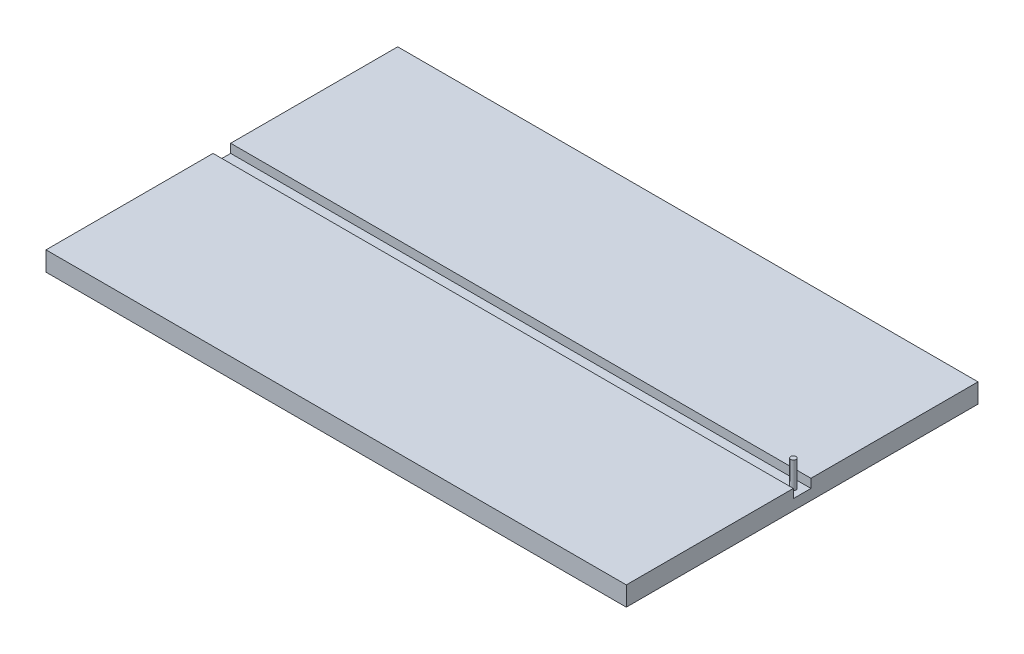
ISO-10303-21;
HEADER;
FILE_DESCRIPTION(('STEP AP214'),'2;1');
FILE_NAME('part.step','',(''),(''),'','','');
FILE_SCHEMA(('AUTOMOTIVE_DESIGN { 1 0 10303 214 1 1 1 1 }'));
ENDSEC;
DATA;
#1=APPLICATION_CONTEXT('core data for automotive mechanical design processes');
#2=APPLICATION_PROTOCOL_DEFINITION('international standard','automotive_design',2000,#1);
#3=PRODUCT_CONTEXT('',#1,'mechanical');
#4=PRODUCT('Part','Part','',(#3));
#5=PRODUCT_RELATED_PRODUCT_CATEGORY('part','',(#4));
#6=PRODUCT_DEFINITION_FORMATION('','',#4);
#7=PRODUCT_DEFINITION_CONTEXT('part definition',#1,'design');
#8=PRODUCT_DEFINITION('design','',#6,#7);
#9=PRODUCT_DEFINITION_SHAPE('','',#8);
#10=(LENGTH_UNIT() NAMED_UNIT(*) SI_UNIT(.MILLI.,.METRE.));
#11=(NAMED_UNIT(*) PLANE_ANGLE_UNIT() SI_UNIT($,.RADIAN.));
#12=(NAMED_UNIT(*) SI_UNIT($,.STERADIAN.) SOLID_ANGLE_UNIT());
#13=UNCERTAINTY_MEASURE_WITH_UNIT(LENGTH_MEASURE(1.E-05),#10,'distance_accuracy_value','');
#14=(GEOMETRIC_REPRESENTATION_CONTEXT(3) GLOBAL_UNCERTAINTY_ASSIGNED_CONTEXT((#13)) GLOBAL_UNIT_ASSIGNED_CONTEXT((#10,
#11,#12)) REPRESENTATION_CONTEXT('',''));
#15=CARTESIAN_POINT('',(0.,0.,0.));
#16=DIRECTION('',(0.,0.,1.));
#17=DIRECTION('',(1.,0.,0.));
#18=AXIS2_PLACEMENT_3D('',#15,#16,#17);
#19=CARTESIAN_POINT('',(0.,6.,0.));
#20=DIRECTION('',(0.,-1.,0.));
#21=DIRECTION('',(0.,0.,-1.));
#22=AXIS2_PLACEMENT_3D('',#19,#20,#21);
#23=PLANE('',#22);
#24=DIRECTION('',(1.,0.,0.));
#25=VECTOR('',#24,1.);
#26=CARTESIAN_POINT('',(0.,6.,-105.));
#27=LINE('',#26,#25);
#28=CARTESIAN_POINT('',(0.,6.,-105.));
#29=VERTEX_POINT('',#28);
#30=CARTESIAN_POINT('',(330.,6.,-105.));
#31=VERTEX_POINT('',#30);
#32=EDGE_CURVE('E48',#29,#31,#27,.T.);
#33=ORIENTED_EDGE('',*,*,#32,.F.);
#34=DIRECTION('',(0.,0.,1.));
#35=VECTOR('',#34,1.);
#36=CARTESIAN_POINT('',(0.,6.,0.));
#37=LINE('',#36,#35);
#38=CARTESIAN_POINT('',(0.,6.,-95.));
#39=VERTEX_POINT('',#38);
#40=EDGE_CURVE('E119',#29,#39,#37,.T.);
#41=ORIENTED_EDGE('',*,*,#40,.T.);
#42=DIRECTION('',(-1.,0.,0.));
#43=VECTOR('',#42,1.);
#44=CARTESIAN_POINT('',(0.,6.,-95.));
#45=LINE('',#44,#43);
#46=CARTESIAN_POINT('',(330.,6.,-95.));
#47=VERTEX_POINT('',#46);
#48=EDGE_CURVE('E120',#47,#39,#45,.T.);
#49=ORIENTED_EDGE('',*,*,#48,.F.);
#50=DIRECTION('',(0.,0.,-1.));
#51=VECTOR('',#50,1.);
#52=CARTESIAN_POINT('',(330.,6.,0.));
#53=LINE('',#52,#51);
#54=EDGE_CURVE('E53',#47,#31,#53,.T.);
#55=ORIENTED_EDGE('',*,*,#54,.T.);
#56=EDGE_LOOP('',(#33,#41,#49,#55));
#57=FACE_BOUND('',#56,.T.);
#58=CARTESIAN_POINT('',(325.,6.,-100.));
#59=DIRECTION('',(0.,-1.,0.));
#60=DIRECTION('',(0.,0.,-1.));
#61=AXIS2_PLACEMENT_3D('',#58,#59,#60);
#62=CIRCLE('',#61,1.50000000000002);
#63=CARTESIAN_POINT('',(325.,6.,-101.5));
#64=VERTEX_POINT('',#63);
#65=EDGE_CURVE('E11',#64,#64,#62,.F.);
#66=ORIENTED_EDGE('',*,*,#65,.F.);
#67=EDGE_LOOP('',(#66));
#68=FACE_BOUND('',#67,.T.);
#69=ADVANCED_FACE('F33',(#57,#68),#23,.F.);
#70=CARTESIAN_POINT('',(0.,6.,0.));
#71=DIRECTION('',(1.,0.,0.));
#72=DIRECTION('',(0.,0.,-1.));
#73=AXIS2_PLACEMENT_3D('',#70,#71,#72);
#74=PLANE('',#73);
#75=DIRECTION('',(0.,0.,1.));
#76=VECTOR('',#75,1.);
#77=CARTESIAN_POINT('',(0.,0.,0.));
#78=LINE('',#77,#76);
#79=CARTESIAN_POINT('',(0.,0.,-200.));
#80=VERTEX_POINT('',#79);
#81=CARTESIAN_POINT('',(0.,0.,0.));
#82=VERTEX_POINT('',#81);
#83=EDGE_CURVE('E151',#80,#82,#78,.T.);
#84=ORIENTED_EDGE('',*,*,#83,.T.);
#85=DIRECTION('',(0.,-1.,0.));
#86=VECTOR('',#85,1.);
#87=CARTESIAN_POINT('',(0.,6.,0.));
#88=LINE('',#87,#86);
#89=CARTESIAN_POINT('',(0.,11.,0.));
#90=VERTEX_POINT('',#89);
#91=EDGE_CURVE('E41',#90,#82,#88,.T.);
#92=ORIENTED_EDGE('',*,*,#91,.F.);
#93=DIRECTION('',(0.,0.,1.));
#94=VECTOR('',#93,1.);
#95=CARTESIAN_POINT('',(0.,11.,0.));
#96=LINE('',#95,#94);
#97=CARTESIAN_POINT('',(0.,11.,-95.));
#98=VERTEX_POINT('',#97);
#99=EDGE_CURVE('E123',#98,#90,#96,.T.);
#100=ORIENTED_EDGE('',*,*,#99,.F.);
#101=DIRECTION('',(0.,-1.,0.));
#102=VECTOR('',#101,1.);
#103=CARTESIAN_POINT('',(0.,11.,-95.));
#104=LINE('',#103,#102);
#105=EDGE_CURVE('E137',#98,#39,#104,.T.);
#106=ORIENTED_EDGE('',*,*,#105,.T.);
#107=ORIENTED_EDGE('',*,*,#40,.F.);
#108=DIRECTION('',(0.,-1.,0.));
#109=VECTOR('',#108,1.);
#110=CARTESIAN_POINT('',(0.,11.,-105.));
#111=LINE('',#110,#109);
#112=CARTESIAN_POINT('',(0.,11.,-105.));
#113=VERTEX_POINT('',#112);
#114=EDGE_CURVE('E100',#113,#29,#111,.T.);
#115=ORIENTED_EDGE('',*,*,#114,.F.);
#116=DIRECTION('',(0.,0.,1.));
#117=VECTOR('',#116,1.);
#118=CARTESIAN_POINT('',(0.,11.,-200.));
#119=LINE('',#118,#117);
#120=CARTESIAN_POINT('',(0.,11.,-200.));
#121=VERTEX_POINT('',#120);
#122=EDGE_CURVE('E107',#121,#113,#119,.T.);
#123=ORIENTED_EDGE('',*,*,#122,.F.);
#124=DIRECTION('',(0.,-1.,0.));
#125=VECTOR('',#124,1.);
#126=CARTESIAN_POINT('',(0.,6.,-200.));
#127=LINE('',#126,#125);
#128=EDGE_CURVE('E154',#121,#80,#127,.T.);
#129=ORIENTED_EDGE('',*,*,#128,.T.);
#130=EDGE_LOOP('',(#84,#92,#100,#106,#107,#115,#123,#129));
#131=FACE_BOUND('',#130,.T.);
#132=ADVANCED_FACE('F35',(#131),#74,.F.);
#133=CARTESIAN_POINT('',(0.,6.,0.));
#134=DIRECTION('',(0.,0.,-1.));
#135=DIRECTION('',(-1.,0.,0.));
#136=AXIS2_PLACEMENT_3D('',#133,#134,#135);
#137=PLANE('',#136);
#138=DIRECTION('',(1.,0.,0.));
#139=VECTOR('',#138,1.);
#140=CARTESIAN_POINT('',(0.,0.,0.));
#141=LINE('',#140,#139);
#142=CARTESIAN_POINT('',(330.,0.,0.));
#143=VERTEX_POINT('',#142);
#144=EDGE_CURVE('E160',#82,#143,#141,.T.);
#145=ORIENTED_EDGE('',*,*,#144,.T.);
#146=DIRECTION('',(0.,-1.,0.));
#147=VECTOR('',#146,1.);
#148=CARTESIAN_POINT('',(330.,6.,0.));
#149=LINE('',#148,#147);
#150=CARTESIAN_POINT('',(330.,11.,0.));
#151=VERTEX_POINT('',#150);
#152=EDGE_CURVE('E167',#151,#143,#149,.T.);
#153=ORIENTED_EDGE('',*,*,#152,.F.);
#154=DIRECTION('',(1.,0.,0.));
#155=VECTOR('',#154,1.);
#156=CARTESIAN_POINT('',(0.,11.,0.));
#157=LINE('',#156,#155);
#158=EDGE_CURVE('E130',#90,#151,#157,.T.);
#159=ORIENTED_EDGE('',*,*,#158,.F.);
#160=ORIENTED_EDGE('',*,*,#91,.T.);
#161=EDGE_LOOP('',(#145,#153,#159,#160));
#162=FACE_BOUND('',#161,.T.);
#163=ADVANCED_FACE('F172',(#162),#137,.F.);
#164=CARTESIAN_POINT('',(330.,6.,0.));
#165=DIRECTION('',(-1.,0.,0.));
#166=DIRECTION('',(0.,0.,1.));
#167=AXIS2_PLACEMENT_3D('',#164,#165,#166);
#168=PLANE('',#167);
#169=DIRECTION('',(0.,0.,-1.));
#170=VECTOR('',#169,1.);
#171=CARTESIAN_POINT('',(330.,0.,0.));
#172=LINE('',#171,#170);
#173=CARTESIAN_POINT('',(330.,0.,-200.));
#174=VERTEX_POINT('',#173);
#175=EDGE_CURVE('E155',#143,#174,#172,.T.);
#176=ORIENTED_EDGE('',*,*,#175,.T.);
#177=DIRECTION('',(0.,-1.,0.));
#178=VECTOR('',#177,1.);
#179=CARTESIAN_POINT('',(330.,6.,-200.));
#180=LINE('',#179,#178);
#181=CARTESIAN_POINT('',(330.,11.,-200.));
#182=VERTEX_POINT('',#181);
#183=EDGE_CURVE('E165',#182,#174,#180,.T.);
#184=ORIENTED_EDGE('',*,*,#183,.F.);
#185=DIRECTION('',(0.,0.,-1.));
#186=VECTOR('',#185,1.);
#187=CARTESIAN_POINT('',(330.,11.,-200.));
#188=LINE('',#187,#186);
#189=CARTESIAN_POINT('',(330.,11.,-105.));
#190=VERTEX_POINT('',#189);
#191=EDGE_CURVE('E106',#190,#182,#188,.T.);
#192=ORIENTED_EDGE('',*,*,#191,.F.);
#193=DIRECTION('',(0.,-1.,0.));
#194=VECTOR('',#193,1.);
#195=CARTESIAN_POINT('',(330.,11.,-105.));
#196=LINE('',#195,#194);
#197=EDGE_CURVE('E102',#190,#31,#196,.T.);
#198=ORIENTED_EDGE('',*,*,#197,.T.);
#199=ORIENTED_EDGE('',*,*,#54,.F.);
#200=DIRECTION('',(0.,-1.,0.));
#201=VECTOR('',#200,1.);
#202=CARTESIAN_POINT('',(330.,11.,-95.));
#203=LINE('',#202,#201);
#204=CARTESIAN_POINT('',(330.,11.,-95.));
#205=VERTEX_POINT('',#204);
#206=EDGE_CURVE('E146',#205,#47,#203,.T.);
#207=ORIENTED_EDGE('',*,*,#206,.F.);
#208=DIRECTION('',(0.,0.,-1.));
#209=VECTOR('',#208,1.);
#210=CARTESIAN_POINT('',(330.,11.,0.));
#211=LINE('',#210,#209);
#212=EDGE_CURVE('E133',#151,#205,#211,.T.);
#213=ORIENTED_EDGE('',*,*,#212,.F.);
#214=ORIENTED_EDGE('',*,*,#152,.T.);
#215=EDGE_LOOP('',(#176,#184,#192,#198,#199,#207,#213,#214));
#216=FACE_BOUND('',#215,.T.);
#217=ADVANCED_FACE('F181',(#216),#168,.F.);
#218=CARTESIAN_POINT('',(0.,6.,-200.));
#219=DIRECTION('',(0.,0.,1.));
#220=DIRECTION('',(1.,0.,0.));
#221=AXIS2_PLACEMENT_3D('',#218,#219,#220);
#222=PLANE('',#221);
#223=DIRECTION('',(-1.,0.,0.));
#224=VECTOR('',#223,1.);
#225=CARTESIAN_POINT('',(0.,0.,-200.));
#226=LINE('',#225,#224);
#227=EDGE_CURVE('E153',#174,#80,#226,.T.);
#228=ORIENTED_EDGE('',*,*,#227,.T.);
#229=ORIENTED_EDGE('',*,*,#128,.F.);
#230=DIRECTION('',(-1.,0.,0.));
#231=VECTOR('',#230,1.);
#232=CARTESIAN_POINT('',(0.,11.,-200.));
#233=LINE('',#232,#231);
#234=EDGE_CURVE('E113',#182,#121,#233,.T.);
#235=ORIENTED_EDGE('',*,*,#234,.F.);
#236=ORIENTED_EDGE('',*,*,#183,.T.);
#237=EDGE_LOOP('',(#228,#229,#235,#236));
#238=FACE_BOUND('',#237,.T.);
#239=ADVANCED_FACE('F183',(#238),#222,.F.);
#240=CARTESIAN_POINT('',(0.,0.,0.));
#241=DIRECTION('',(0.,-1.,0.));
#242=DIRECTION('',(0.,0.,-1.));
#243=AXIS2_PLACEMENT_3D('',#240,#241,#242);
#244=PLANE('',#243);
#245=ORIENTED_EDGE('',*,*,#83,.F.);
#246=ORIENTED_EDGE('',*,*,#227,.F.);
#247=ORIENTED_EDGE('',*,*,#175,.F.);
#248=ORIENTED_EDGE('',*,*,#144,.F.);
#249=EDGE_LOOP('',(#245,#246,#247,#248));
#250=FACE_BOUND('',#249,.T.);
#251=ADVANCED_FACE('F178',(#250),#244,.T.);
#252=CARTESIAN_POINT('',(0.,11.,-95.));
#253=DIRECTION('',(0.,0.,1.));
#254=DIRECTION('',(1.,0.,0.));
#255=AXIS2_PLACEMENT_3D('',#252,#253,#254);
#256=PLANE('',#255);
#257=ORIENTED_EDGE('',*,*,#48,.T.);
#258=ORIENTED_EDGE('',*,*,#105,.F.);
#259=DIRECTION('',(-1.,0.,0.));
#260=VECTOR('',#259,1.);
#261=CARTESIAN_POINT('',(0.,11.,-95.));
#262=LINE('',#261,#260);
#263=EDGE_CURVE('E135',#205,#98,#262,.T.);
#264=ORIENTED_EDGE('',*,*,#263,.F.);
#265=ORIENTED_EDGE('',*,*,#206,.T.);
#266=EDGE_LOOP('',(#257,#258,#264,#265));
#267=FACE_BOUND('',#266,.T.);
#268=ADVANCED_FACE('F206',(#267),#256,.F.);
#269=CARTESIAN_POINT('',(0.,11.,0.));
#270=DIRECTION('',(0.,-1.,0.));
#271=DIRECTION('',(0.,0.,-1.));
#272=AXIS2_PLACEMENT_3D('',#269,#270,#271);
#273=PLANE('',#272);
#274=ORIENTED_EDGE('',*,*,#99,.T.);
#275=ORIENTED_EDGE('',*,*,#158,.T.);
#276=ORIENTED_EDGE('',*,*,#212,.T.);
#277=ORIENTED_EDGE('',*,*,#263,.T.);
#278=EDGE_LOOP('',(#274,#275,#276,#277));
#279=FACE_BOUND('',#278,.T.);
#280=ADVANCED_FACE('F236',(#279),#273,.F.);
#281=CARTESIAN_POINT('',(0.,11.,-105.));
#282=DIRECTION('',(0.,0.,-1.));
#283=DIRECTION('',(-1.,0.,0.));
#284=AXIS2_PLACEMENT_3D('',#281,#282,#283);
#285=PLANE('',#284);
#286=ORIENTED_EDGE('',*,*,#32,.T.);
#287=ORIENTED_EDGE('',*,*,#197,.F.);
#288=DIRECTION('',(1.,0.,0.));
#289=VECTOR('',#288,1.);
#290=CARTESIAN_POINT('',(0.,11.,-105.));
#291=LINE('',#290,#289);
#292=EDGE_CURVE('E96',#113,#190,#291,.T.);
#293=ORIENTED_EDGE('',*,*,#292,.F.);
#294=ORIENTED_EDGE('',*,*,#114,.T.);
#295=EDGE_LOOP('',(#286,#287,#293,#294));
#296=FACE_BOUND('',#295,.T.);
#297=ADVANCED_FACE('F98',(#296),#285,.F.);
#298=CARTESIAN_POINT('',(0.,11.,0.));
#299=DIRECTION('',(0.,1.,0.));
#300=DIRECTION('',(0.,0.,1.));
#301=AXIS2_PLACEMENT_3D('',#298,#299,#300);
#302=PLANE('',#301);
#303=ORIENTED_EDGE('',*,*,#122,.T.);
#304=ORIENTED_EDGE('',*,*,#292,.T.);
#305=ORIENTED_EDGE('',*,*,#191,.T.);
#306=ORIENTED_EDGE('',*,*,#234,.T.);
#307=EDGE_LOOP('',(#303,#304,#305,#306));
#308=FACE_BOUND('',#307,.T.);
#309=ADVANCED_FACE('F111',(#308),#302,.T.);
#310=CARTESIAN_POINT('',(325.,21.,-100.));
#311=DIRECTION('',(0.,-1.,0.));
#312=DIRECTION('',(0.,0.,-1.));
#313=AXIS2_PLACEMENT_3D('',#310,#311,#312);
#314=CYLINDRICAL_SURFACE('',#313,1.50000000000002);
#315=CARTESIAN_POINT('',(325.,21.,-100.));
#316=DIRECTION('',(0.,1.,0.));
#317=DIRECTION('',(0.,0.,1.));
#318=AXIS2_PLACEMENT_3D('',#315,#316,#317);
#319=CIRCLE('',#318,1.50000000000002);
#320=CARTESIAN_POINT('',(325.,21.,-98.5));
#321=VERTEX_POINT('',#320);
#322=EDGE_CURVE('E186',#321,#321,#319,.T.);
#323=ORIENTED_EDGE('',*,*,#322,.F.);
#324=EDGE_LOOP('',(#323));
#325=FACE_BOUND('',#324,.T.);
#326=ORIENTED_EDGE('',*,*,#65,.T.);
#327=EDGE_LOOP('',(#326));
#328=FACE_BOUND('',#327,.T.);
#329=ADVANCED_FACE('F193',(#325,#328),#314,.T.);
#330=CARTESIAN_POINT('',(325.,21.,-100.));
#331=DIRECTION('',(0.,1.,0.));
#332=DIRECTION('',(0.,0.,1.));
#333=AXIS2_PLACEMENT_3D('',#330,#331,#332);
#334=PLANE('',#333);
#335=ORIENTED_EDGE('',*,*,#322,.T.);
#336=EDGE_LOOP('',(#335));
#337=FACE_BOUND('',#336,.T.);
#338=ADVANCED_FACE('F191',(#337),#334,.T.);
#339=CLOSED_SHELL('',(#69,#132,#163,#217,#239,#251,#268,#280,#297,#309,#329,#338));
#340=MANIFOLD_SOLID_BREP('B2',#339);
#341=ADVANCED_BREP_SHAPE_REPRESENTATION('',(#18,#340),#14);
#342=SHAPE_DEFINITION_REPRESENTATION(#9,#341);
ENDSEC;
END-ISO-10303-21;
